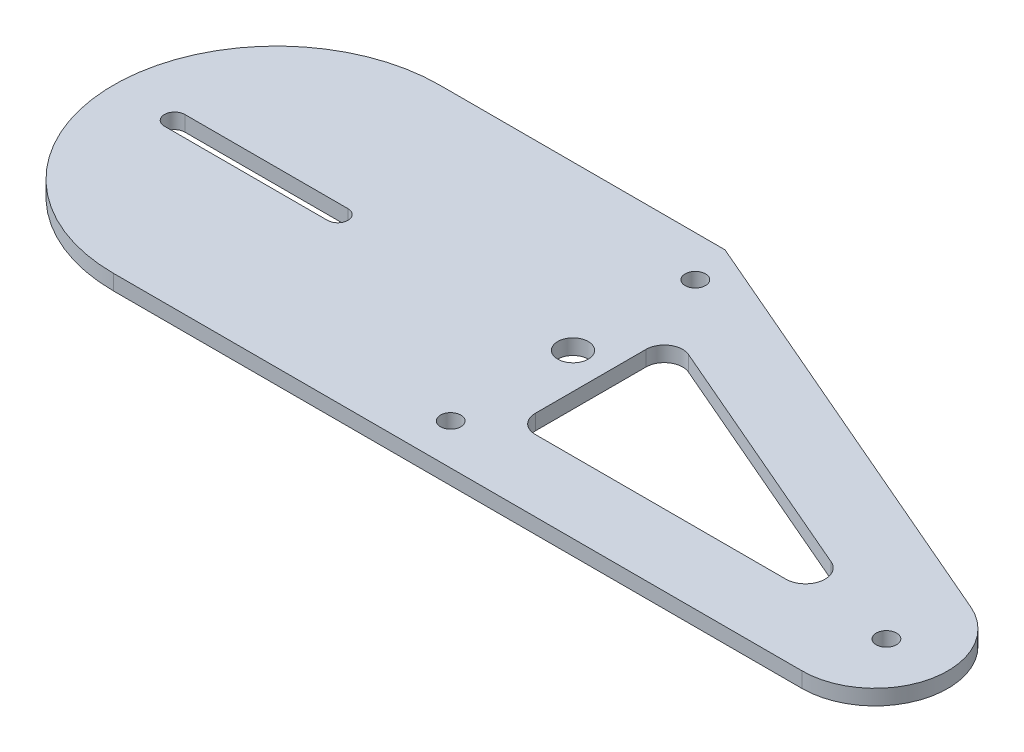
ISO-10303-21;
HEADER;
FILE_DESCRIPTION(('STEP AP214'),'2;1');
FILE_NAME('part.step','',(''),(''),'','','');
FILE_SCHEMA(('AUTOMOTIVE_DESIGN { 1 0 10303 214 1 1 1 1 }'));
ENDSEC;
DATA;
#1=APPLICATION_CONTEXT('core data for automotive mechanical design processes');
#2=APPLICATION_PROTOCOL_DEFINITION('international standard','automotive_design',2000,#1);
#3=PRODUCT_CONTEXT('',#1,'mechanical');
#4=PRODUCT('Part','Part','',(#3));
#5=PRODUCT_RELATED_PRODUCT_CATEGORY('part','',(#4));
#6=PRODUCT_DEFINITION_FORMATION('','',#4);
#7=PRODUCT_DEFINITION_CONTEXT('part definition',#1,'design');
#8=PRODUCT_DEFINITION('design','',#6,#7);
#9=PRODUCT_DEFINITION_SHAPE('','',#8);
#10=(LENGTH_UNIT() NAMED_UNIT(*) SI_UNIT(.MILLI.,.METRE.));
#11=(NAMED_UNIT(*) PLANE_ANGLE_UNIT() SI_UNIT($,.RADIAN.));
#12=(NAMED_UNIT(*) SI_UNIT($,.STERADIAN.) SOLID_ANGLE_UNIT());
#13=UNCERTAINTY_MEASURE_WITH_UNIT(LENGTH_MEASURE(1.E-05),#10,'distance_accuracy_value','');
#14=(GEOMETRIC_REPRESENTATION_CONTEXT(3) GLOBAL_UNCERTAINTY_ASSIGNED_CONTEXT((#13)) GLOBAL_UNIT_ASSIGNED_CONTEXT((#10,
#11,#12)) REPRESENTATION_CONTEXT('',''));
#15=CARTESIAN_POINT('',(0.,0.,0.));
#16=DIRECTION('',(0.,0.,1.));
#17=DIRECTION('',(1.,0.,0.));
#18=AXIS2_PLACEMENT_3D('',#15,#16,#17);
#19=CARTESIAN_POINT('',(-184.702735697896,9.525,-57.1499999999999));
#20=DIRECTION('',(0.,1.,0.));
#21=DIRECTION('',(0.,0.,1.));
#22=AXIS2_PLACEMENT_3D('',#19,#20,#21);
#23=PLANE('',#22);
#24=DIRECTION('',(1.,0.,0.));
#25=VECTOR('',#24,1.);
#26=CARTESIAN_POINT('',(-248.202735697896,9.525,-50.7999999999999));
#27=LINE('',#26,#25);
#28=CARTESIAN_POINT('',(-248.202735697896,9.525,-50.7999999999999));
#29=VERTEX_POINT('',#28);
#30=CARTESIAN_POINT('',(-146.602735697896,9.525,-50.7999999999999));
#31=VERTEX_POINT('',#30);
#32=EDGE_CURVE('E153',#29,#31,#27,.T.);
#33=ORIENTED_EDGE('',*,*,#32,.F.);
#34=CARTESIAN_POINT('',(-248.202735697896,9.525,-57.1499999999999));
#35=DIRECTION('',(0.,1.,0.));
#36=DIRECTION('',(0.,0.,1.));
#37=AXIS2_PLACEMENT_3D('',#34,#35,#36);
#38=CIRCLE('',#37,6.35);
#39=CARTESIAN_POINT('',(-248.202735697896,9.525,-63.4999999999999));
#40=VERTEX_POINT('',#39);
#41=EDGE_CURVE('E145',#40,#29,#38,.T.);
#42=ORIENTED_EDGE('',*,*,#41,.F.);
#43=DIRECTION('',(-1.,0.,0.));
#44=VECTOR('',#43,1.);
#45=CARTESIAN_POINT('',(-248.202735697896,9.525,-63.4999999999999));
#46=LINE('',#45,#44);
#47=CARTESIAN_POINT('',(-146.602735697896,9.525,-63.4999999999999));
#48=VERTEX_POINT('',#47);
#49=EDGE_CURVE('E168',#48,#40,#46,.T.);
#50=ORIENTED_EDGE('',*,*,#49,.F.);
#51=CARTESIAN_POINT('',(-146.602735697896,9.525,-57.1499999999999));
#52=DIRECTION('',(0.,1.,0.));
#53=DIRECTION('',(0.,0.,-1.));
#54=AXIS2_PLACEMENT_3D('',#51,#52,#53);
#55=CIRCLE('',#54,6.35);
#56=EDGE_CURVE('E166',#31,#48,#55,.T.);
#57=ORIENTED_EDGE('',*,*,#56,.F.);
#58=EDGE_LOOP('',(#33,#42,#50,#57));
#59=FACE_BOUND('',#58,.T.);
#60=CARTESIAN_POINT('',(0.,9.525,19.0500000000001));
#61=DIRECTION('',(0.,1.,0.));
#62=DIRECTION('',(0.,0.,1.));
#63=AXIS2_PLACEMENT_3D('',#60,#61,#62);
#64=CIRCLE('',#63,6.35000000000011);
#65=CARTESIAN_POINT('',(0.,9.525,25.4000000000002));
#66=VERTEX_POINT('',#65);
#67=EDGE_CURVE('E190',#66,#66,#64,.T.);
#68=ORIENTED_EDGE('',*,*,#67,.F.);
#69=EDGE_LOOP('',(#68));
#70=FACE_BOUND('',#69,.T.);
#71=DIRECTION('',(-0.918220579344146,0.,-0.396069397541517));
#72=VECTOR('',#71,1.);
#73=CARTESIAN_POINT('',(194.631834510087,9.525,-23.4103238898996));
#74=LINE('',#73,#72);
#75=CARTESIAN_POINT('',(194.631834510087,9.525,-23.4103238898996));
#76=VERTEX_POINT('',#75);
#77=CARTESIAN_POINT('',(38.1820732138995,9.525,-90.8940680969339));
#78=VERTEX_POINT('',#77);
#79=EDGE_CURVE('E204',#76,#78,#74,.T.);
#80=ORIENTED_EDGE('',*,*,#79,.F.);
#81=CARTESIAN_POINT('',(189.798129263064,9.525,-12.2041876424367));
#82=DIRECTION('',(0.,1.,0.));
#83=DIRECTION('',(0.,0.,-1.));
#84=AXIS2_PLACEMENT_3D('',#81,#82,#83);
#85=CIRCLE('',#84,12.2041876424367);
#86=CARTESIAN_POINT('',(189.798129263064,9.525,0.));
#87=VERTEX_POINT('',#86);
#88=EDGE_CURVE('E202',#87,#76,#85,.T.);
#89=ORIENTED_EDGE('',*,*,#88,.F.);
#90=DIRECTION('',(1.,0.,0.));
#91=VECTOR('',#90,1.);
#92=CARTESIAN_POINT('',(33.655,9.525,0.));
#93=LINE('',#92,#91);
#94=CARTESIAN_POINT('',(33.655,9.525,0.));
#95=VERTEX_POINT('',#94);
#96=EDGE_CURVE('E214',#95,#87,#93,.T.);
#97=ORIENTED_EDGE('',*,*,#96,.F.);
#98=CARTESIAN_POINT('',(33.655,9.525,-11.43));
#99=DIRECTION('',(0.,1.,0.));
#100=DIRECTION('',(0.,0.,1.));
#101=AXIS2_PLACEMENT_3D('',#98,#99,#100);
#102=CIRCLE('',#101,11.43);
#103=CARTESIAN_POINT('',(22.225,9.525,-11.43));
#104=VERTEX_POINT('',#103);
#105=EDGE_CURVE('E211',#104,#95,#102,.T.);
#106=ORIENTED_EDGE('',*,*,#105,.F.);
#107=DIRECTION('',(0.,0.,1.));
#108=VECTOR('',#107,1.);
#109=CARTESIAN_POINT('',(22.225,9.525,-80.3988068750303));
#110=LINE('',#109,#108);
#111=CARTESIAN_POINT('',(22.225,9.525,-80.3988068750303));
#112=VERTEX_POINT('',#111);
#113=EDGE_CURVE('E209',#112,#104,#110,.T.);
#114=ORIENTED_EDGE('',*,*,#113,.F.);
#115=CARTESIAN_POINT('',(33.655,9.525,-80.3988068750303));
#116=DIRECTION('',(0.,1.,0.));
#117=DIRECTION('',(0.,0.,1.));
#118=AXIS2_PLACEMENT_3D('',#115,#116,#117);
#119=CIRCLE('',#118,11.43);
#120=EDGE_CURVE('E207',#78,#112,#119,.T.);
#121=ORIENTED_EDGE('',*,*,#120,.F.);
#122=EDGE_LOOP('',(#80,#89,#97,#106,#114,#121));
#123=FACE_BOUND('',#122,.T.);
#124=CARTESIAN_POINT('',(-184.702735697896,9.525,-57.1499999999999));
#125=DIRECTION('',(0.,1.,0.));
#126=DIRECTION('',(0.,0.,1.));
#127=AXIS2_PLACEMENT_3D('',#124,#125,#126);
#128=CIRCLE('',#127,101.6);
#129=CARTESIAN_POINT('',(-184.702735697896,9.525,-158.75));
#130=VERTEX_POINT('',#129);
#131=CARTESIAN_POINT('',(-184.702735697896,9.525,44.4500000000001));
#132=VERTEX_POINT('',#131);
#133=EDGE_CURVE('E247',#130,#132,#128,.T.);
#134=ORIENTED_EDGE('',*,*,#133,.T.);
#135=DIRECTION('',(1.,0.,0.));
#136=VECTOR('',#135,1.);
#137=CARTESIAN_POINT('',(-184.702735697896,9.525,44.4500000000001));
#138=LINE('',#137,#136);
#139=CARTESIAN_POINT('',(244.363682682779,9.525,44.4500000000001));
#140=VERTEX_POINT('',#139);
#141=EDGE_CURVE('E250',#132,#140,#138,.T.);
#142=ORIENTED_EDGE('',*,*,#141,.T.);
#143=CARTESIAN_POINT('',(244.363682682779,9.525,-0.937628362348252));
#144=DIRECTION('',(0.,1.,0.));
#145=DIRECTION('',(0.,0.,-1.));
#146=AXIS2_PLACEMENT_3D('',#143,#144,#145);
#147=CIRCLE('',#146,45.3876283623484);
#148=CARTESIAN_POINT('',(262.340333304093,9.525,-42.6134827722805));
#149=VERTEX_POINT('',#148);
#150=EDGE_CURVE('E253',#140,#149,#147,.T.);
#151=ORIENTED_EDGE('',*,*,#150,.T.);
#152=DIRECTION('',(-0.918220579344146,0.,-0.396069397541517));
#153=VECTOR('',#152,1.);
#154=CARTESIAN_POINT('',(262.340333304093,9.525,-42.6134827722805));
#155=LINE('',#154,#153);
#156=CARTESIAN_POINT('',(-6.30078143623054,9.525,-158.490350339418));
#157=VERTEX_POINT('',#156);
#158=EDGE_CURVE('E255',#149,#157,#155,.T.);
#159=ORIENTED_EDGE('',*,*,#158,.T.);
#160=CARTESIAN_POINT('',(-7.55830177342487,9.525,-155.575));
#161=DIRECTION('',(0.,1.,0.));
#162=DIRECTION('',(0.,0.,1.));
#163=AXIS2_PLACEMENT_3D('',#160,#161,#162);
#164=CIRCLE('',#163,3.17500000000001);
#165=CARTESIAN_POINT('',(-7.55830177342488,9.525,-158.75));
#166=VERTEX_POINT('',#165);
#167=EDGE_CURVE('E257',#157,#166,#164,.T.);
#168=ORIENTED_EDGE('',*,*,#167,.T.);
#169=DIRECTION('',(-1.,0.,0.));
#170=VECTOR('',#169,1.);
#171=CARTESIAN_POINT('',(-7.55830177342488,9.525,-158.75));
#172=LINE('',#171,#170);
#173=EDGE_CURVE('E259',#166,#130,#172,.T.);
#174=ORIENTED_EDGE('',*,*,#173,.T.);
#175=EDGE_LOOP('',(#134,#142,#151,#159,#168,#174));
#176=FACE_BOUND('',#175,.T.);
#177=CARTESIAN_POINT('',(0.,9.525,-133.35));
#178=DIRECTION('',(0.,1.,0.));
#179=DIRECTION('',(0.,0.,1.));
#180=AXIS2_PLACEMENT_3D('',#177,#178,#179);
#181=CIRCLE('',#180,6.35000000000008);
#182=CARTESIAN_POINT('',(0.,9.525,-127.));
#183=VERTEX_POINT('',#182);
#184=EDGE_CURVE('E196',#183,#183,#181,.T.);
#185=ORIENTED_EDGE('',*,*,#184,.F.);
#186=EDGE_LOOP('',(#185));
#187=FACE_BOUND('',#186,.T.);
#188=CARTESIAN_POINT('',(0.,9.525,-57.1499999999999));
#189=DIRECTION('',(0.,1.,0.));
#190=DIRECTION('',(0.,0.,1.));
#191=AXIS2_PLACEMENT_3D('',#188,#189,#190);
#192=CIRCLE('',#191,9.52500000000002);
#193=CARTESIAN_POINT('',(0.,9.525,-47.6249999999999));
#194=VERTEX_POINT('',#193);
#195=EDGE_CURVE('E184',#194,#194,#192,.T.);
#196=ORIENTED_EDGE('',*,*,#195,.F.);
#197=EDGE_LOOP('',(#196));
#198=FACE_BOUND('',#197,.T.);
#199=CARTESIAN_POINT('',(253.352007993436,9.525,0.918258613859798));
#200=DIRECTION('',(0.,1.,0.));
#201=DIRECTION('',(0.,0.,1.));
#202=AXIS2_PLACEMENT_3D('',#199,#200,#201);
#203=CIRCLE('',#202,6.35);
#204=CARTESIAN_POINT('',(253.352007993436,9.525,7.2682586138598));
#205=VERTEX_POINT('',#204);
#206=EDGE_CURVE('E174',#205,#205,#203,.T.);
#207=ORIENTED_EDGE('',*,*,#206,.F.);
#208=EDGE_LOOP('',(#207));
#209=FACE_BOUND('',#208,.T.);
#210=ADVANCED_FACE('F32',(#59,#70,#123,#176,#187,#198,#209),#23,.T.);
#211=CARTESIAN_POINT('',(-184.702735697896,0.,-57.1499999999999));
#212=DIRECTION('',(0.,1.,0.));
#213=DIRECTION('',(0.,0.,1.));
#214=AXIS2_PLACEMENT_3D('',#211,#212,#213);
#215=PLANE('',#214);
#216=CARTESIAN_POINT('',(-248.202735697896,0.,-57.1499999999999));
#217=DIRECTION('',(0.,1.,0.));
#218=DIRECTION('',(0.,0.,1.));
#219=AXIS2_PLACEMENT_3D('',#216,#217,#218);
#220=CIRCLE('',#219,6.35);
#221=CARTESIAN_POINT('',(-248.202735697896,0.,-63.4999999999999));
#222=VERTEX_POINT('',#221);
#223=CARTESIAN_POINT('',(-248.202735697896,0.,-50.7999999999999));
#224=VERTEX_POINT('',#223);
#225=EDGE_CURVE('E55',#222,#224,#220,.T.);
#226=ORIENTED_EDGE('',*,*,#225,.T.);
#227=DIRECTION('',(1.,0.,0.));
#228=VECTOR('',#227,1.);
#229=CARTESIAN_POINT('',(-248.202735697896,0.,-50.7999999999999));
#230=LINE('',#229,#228);
#231=CARTESIAN_POINT('',(-146.602735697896,0.,-50.7999999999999));
#232=VERTEX_POINT('',#231);
#233=EDGE_CURVE('E160',#224,#232,#230,.T.);
#234=ORIENTED_EDGE('',*,*,#233,.T.);
#235=CARTESIAN_POINT('',(-146.602735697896,0.,-57.1499999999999));
#236=DIRECTION('',(0.,1.,0.));
#237=DIRECTION('',(0.,0.,-1.));
#238=AXIS2_PLACEMENT_3D('',#235,#236,#237);
#239=CIRCLE('',#238,6.35);
#240=CARTESIAN_POINT('',(-146.602735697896,0.,-63.4999999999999));
#241=VERTEX_POINT('',#240);
#242=EDGE_CURVE('E176',#232,#241,#239,.T.);
#243=ORIENTED_EDGE('',*,*,#242,.T.);
#244=DIRECTION('',(-1.,0.,0.));
#245=VECTOR('',#244,1.);
#246=CARTESIAN_POINT('',(-248.202735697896,0.,-63.4999999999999));
#247=LINE('',#246,#245);
#248=EDGE_CURVE('E154',#241,#222,#247,.T.);
#249=ORIENTED_EDGE('',*,*,#248,.T.);
#250=EDGE_LOOP('',(#226,#234,#243,#249));
#251=FACE_BOUND('',#250,.T.);
#252=CARTESIAN_POINT('',(0.,0.,19.0500000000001));
#253=DIRECTION('',(0.,1.,0.));
#254=DIRECTION('',(0.,0.,1.));
#255=AXIS2_PLACEMENT_3D('',#252,#253,#254);
#256=CIRCLE('',#255,6.35000000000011);
#257=CARTESIAN_POINT('',(0.,0.,25.4000000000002));
#258=VERTEX_POINT('',#257);
#259=EDGE_CURVE('E187',#258,#258,#256,.T.);
#260=ORIENTED_EDGE('',*,*,#259,.T.);
#261=EDGE_LOOP('',(#260));
#262=FACE_BOUND('',#261,.T.);
#263=CARTESIAN_POINT('',(189.798129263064,0.,-12.2041876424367));
#264=DIRECTION('',(0.,1.,0.));
#265=DIRECTION('',(0.,0.,-1.));
#266=AXIS2_PLACEMENT_3D('',#263,#264,#265);
#267=CIRCLE('',#266,12.2041876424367);
#268=CARTESIAN_POINT('',(189.798129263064,0.,0.));
#269=VERTEX_POINT('',#268);
#270=CARTESIAN_POINT('',(194.631834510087,0.,-23.4103238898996));
#271=VERTEX_POINT('',#270);
#272=EDGE_CURVE('E199',#269,#271,#267,.T.);
#273=ORIENTED_EDGE('',*,*,#272,.T.);
#274=DIRECTION('',(-0.918220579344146,0.,-0.396069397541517));
#275=VECTOR('',#274,1.);
#276=CARTESIAN_POINT('',(194.631834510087,0.,-23.4103238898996));
#277=LINE('',#276,#275);
#278=CARTESIAN_POINT('',(38.1820732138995,0.,-90.8940680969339));
#279=VERTEX_POINT('',#278);
#280=EDGE_CURVE('E219',#271,#279,#277,.T.);
#281=ORIENTED_EDGE('',*,*,#280,.T.);
#282=CARTESIAN_POINT('',(33.655,0.,-80.3988068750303));
#283=DIRECTION('',(0.,1.,0.));
#284=DIRECTION('',(0.,0.,1.));
#285=AXIS2_PLACEMENT_3D('',#282,#283,#284);
#286=CIRCLE('',#285,11.43);
#287=CARTESIAN_POINT('',(22.225,0.,-80.3988068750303));
#288=VERTEX_POINT('',#287);
#289=EDGE_CURVE('E222',#279,#288,#286,.T.);
#290=ORIENTED_EDGE('',*,*,#289,.T.);
#291=DIRECTION('',(0.,0.,1.));
#292=VECTOR('',#291,1.);
#293=CARTESIAN_POINT('',(22.225,0.,-80.3988068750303));
#294=LINE('',#293,#292);
#295=CARTESIAN_POINT('',(22.225,0.,-11.43));
#296=VERTEX_POINT('',#295);
#297=EDGE_CURVE('E225',#288,#296,#294,.T.);
#298=ORIENTED_EDGE('',*,*,#297,.T.);
#299=CARTESIAN_POINT('',(33.655,0.,-11.43));
#300=DIRECTION('',(0.,1.,0.));
#301=DIRECTION('',(0.,0.,1.));
#302=AXIS2_PLACEMENT_3D('',#299,#300,#301);
#303=CIRCLE('',#302,11.43);
#304=CARTESIAN_POINT('',(33.655,0.,0.));
#305=VERTEX_POINT('',#304);
#306=EDGE_CURVE('E228',#296,#305,#303,.T.);
#307=ORIENTED_EDGE('',*,*,#306,.T.);
#308=DIRECTION('',(1.,0.,0.));
#309=VECTOR('',#308,1.);
#310=CARTESIAN_POINT('',(33.655,0.,0.));
#311=LINE('',#310,#309);
#312=EDGE_CURVE('E205',#305,#269,#311,.T.);
#313=ORIENTED_EDGE('',*,*,#312,.T.);
#314=EDGE_LOOP('',(#273,#281,#290,#298,#307,#313));
#315=FACE_BOUND('',#314,.T.);
#316=CARTESIAN_POINT('',(-184.702735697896,0.,-57.1499999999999));
#317=DIRECTION('',(0.,1.,0.));
#318=DIRECTION('',(0.,0.,1.));
#319=AXIS2_PLACEMENT_3D('',#316,#317,#318);
#320=CIRCLE('',#319,101.6);
#321=CARTESIAN_POINT('',(-184.702735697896,0.,-158.75));
#322=VERTEX_POINT('',#321);
#323=CARTESIAN_POINT('',(-184.702735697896,0.,44.4500000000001));
#324=VERTEX_POINT('',#323);
#325=EDGE_CURVE('E246',#322,#324,#320,.T.);
#326=ORIENTED_EDGE('',*,*,#325,.F.);
#327=DIRECTION('',(-1.,0.,0.));
#328=VECTOR('',#327,1.);
#329=CARTESIAN_POINT('',(-7.55830177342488,0.,-158.75));
#330=LINE('',#329,#328);
#331=CARTESIAN_POINT('',(-7.55830177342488,0.,-158.75));
#332=VERTEX_POINT('',#331);
#333=EDGE_CURVE('E251',#332,#322,#330,.T.);
#334=ORIENTED_EDGE('',*,*,#333,.F.);
#335=CARTESIAN_POINT('',(-7.55830177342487,0.,-155.575));
#336=DIRECTION('',(0.,1.,0.));
#337=DIRECTION('',(0.,0.,1.));
#338=AXIS2_PLACEMENT_3D('',#335,#336,#337);
#339=CIRCLE('',#338,3.17500000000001);
#340=CARTESIAN_POINT('',(-6.30078143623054,0.,-158.490350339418));
#341=VERTEX_POINT('',#340);
#342=EDGE_CURVE('E270',#341,#332,#339,.T.);
#343=ORIENTED_EDGE('',*,*,#342,.F.);
#344=DIRECTION('',(-0.918220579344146,0.,-0.396069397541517));
#345=VECTOR('',#344,1.);
#346=CARTESIAN_POINT('',(262.340333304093,0.,-42.6134827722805));
#347=LINE('',#346,#345);
#348=CARTESIAN_POINT('',(262.340333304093,0.,-42.6134827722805));
#349=VERTEX_POINT('',#348);
#350=EDGE_CURVE('E268',#349,#341,#347,.T.);
#351=ORIENTED_EDGE('',*,*,#350,.F.);
#352=CARTESIAN_POINT('',(244.363682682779,0.,-0.937628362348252));
#353=DIRECTION('',(0.,1.,0.));
#354=DIRECTION('',(0.,0.,-1.));
#355=AXIS2_PLACEMENT_3D('',#352,#353,#354);
#356=CIRCLE('',#355,45.3876283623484);
#357=CARTESIAN_POINT('',(244.363682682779,0.,44.4500000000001));
#358=VERTEX_POINT('',#357);
#359=EDGE_CURVE('E266',#358,#349,#356,.T.);
#360=ORIENTED_EDGE('',*,*,#359,.F.);
#361=DIRECTION('',(1.,0.,0.));
#362=VECTOR('',#361,1.);
#363=CARTESIAN_POINT('',(-184.702735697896,0.,44.4500000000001));
#364=LINE('',#363,#362);
#365=EDGE_CURVE('E264',#324,#358,#364,.T.);
#366=ORIENTED_EDGE('',*,*,#365,.F.);
#367=EDGE_LOOP('',(#326,#334,#343,#351,#360,#366));
#368=FACE_BOUND('',#367,.T.);
#369=CARTESIAN_POINT('',(0.,0.,-133.35));
#370=DIRECTION('',(0.,1.,0.));
#371=DIRECTION('',(0.,0.,1.));
#372=AXIS2_PLACEMENT_3D('',#369,#370,#371);
#373=CIRCLE('',#372,6.35000000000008);
#374=CARTESIAN_POINT('',(0.,0.,-127.));
#375=VERTEX_POINT('',#374);
#376=EDGE_CURVE('E193',#375,#375,#373,.T.);
#377=ORIENTED_EDGE('',*,*,#376,.T.);
#378=EDGE_LOOP('',(#377));
#379=FACE_BOUND('',#378,.T.);
#380=CARTESIAN_POINT('',(0.,0.,-57.1499999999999));
#381=DIRECTION('',(0.,1.,0.));
#382=DIRECTION('',(0.,0.,1.));
#383=AXIS2_PLACEMENT_3D('',#380,#381,#382);
#384=CIRCLE('',#383,9.52500000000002);
#385=CARTESIAN_POINT('',(0.,0.,-47.6249999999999));
#386=VERTEX_POINT('',#385);
#387=EDGE_CURVE('E161',#386,#386,#384,.T.);
#388=ORIENTED_EDGE('',*,*,#387,.T.);
#389=EDGE_LOOP('',(#388));
#390=FACE_BOUND('',#389,.T.);
#391=CARTESIAN_POINT('',(253.352007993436,0.,0.918258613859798));
#392=DIRECTION('',(0.,1.,0.));
#393=DIRECTION('',(0.,0.,1.));
#394=AXIS2_PLACEMENT_3D('',#391,#392,#393);
#395=CIRCLE('',#394,6.35);
#396=CARTESIAN_POINT('',(253.352007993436,0.,7.2682586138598));
#397=VERTEX_POINT('',#396);
#398=EDGE_CURVE('E387',#397,#397,#395,.T.);
#399=ORIENTED_EDGE('',*,*,#398,.T.);
#400=EDGE_LOOP('',(#399));
#401=FACE_BOUND('',#400,.T.);
#402=ADVANCED_FACE('F294',(#251,#262,#315,#368,#379,#390,#401),#215,.F.);
#403=CARTESIAN_POINT('',(-184.702735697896,9.525,-57.1499999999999));
#404=DIRECTION('',(0.,-1.,0.));
#405=DIRECTION('',(0.,0.,-1.));
#406=AXIS2_PLACEMENT_3D('',#403,#404,#405);
#407=CYLINDRICAL_SURFACE('',#406,101.6);
#408=ORIENTED_EDGE('',*,*,#325,.T.);
#409=DIRECTION('',(0.,-1.,0.));
#410=VECTOR('',#409,1.);
#411=CARTESIAN_POINT('',(-184.702735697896,9.525,44.4500000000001));
#412=LINE('',#411,#410);
#413=EDGE_CURVE('E11',#132,#324,#412,.T.);
#414=ORIENTED_EDGE('',*,*,#413,.F.);
#415=ORIENTED_EDGE('',*,*,#133,.F.);
#416=DIRECTION('',(0.,-1.,0.));
#417=VECTOR('',#416,1.);
#418=CARTESIAN_POINT('',(-184.702735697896,9.525,-158.75));
#419=LINE('',#418,#417);
#420=EDGE_CURVE('E261',#130,#322,#419,.T.);
#421=ORIENTED_EDGE('',*,*,#420,.T.);
#422=EDGE_LOOP('',(#408,#414,#415,#421));
#423=FACE_BOUND('',#422,.T.);
#424=ADVANCED_FACE('F34',(#423),#407,.T.);
#425=CARTESIAN_POINT('',(-184.702735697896,9.525,44.4500000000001));
#426=DIRECTION('',(0.,0.,-1.));
#427=DIRECTION('',(-1.,0.,0.));
#428=AXIS2_PLACEMENT_3D('',#425,#426,#427);
#429=PLANE('',#428);
#430=ORIENTED_EDGE('',*,*,#365,.T.);
#431=DIRECTION('',(0.,-1.,0.));
#432=VECTOR('',#431,1.);
#433=CARTESIAN_POINT('',(244.363682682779,9.525,44.4500000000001));
#434=LINE('',#433,#432);
#435=EDGE_CURVE('E40',#140,#358,#434,.T.);
#436=ORIENTED_EDGE('',*,*,#435,.F.);
#437=ORIENTED_EDGE('',*,*,#141,.F.);
#438=ORIENTED_EDGE('',*,*,#413,.T.);
#439=EDGE_LOOP('',(#430,#436,#437,#438));
#440=FACE_BOUND('',#439,.T.);
#441=ADVANCED_FACE('F312',(#440),#429,.F.);
#442=CARTESIAN_POINT('',(244.363682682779,9.525,-0.937628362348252));
#443=DIRECTION('',(0.,-1.,0.));
#444=DIRECTION('',(0.,0.,-1.));
#445=AXIS2_PLACEMENT_3D('',#442,#443,#444);
#446=CYLINDRICAL_SURFACE('',#445,45.3876283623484);
#447=ORIENTED_EDGE('',*,*,#359,.T.);
#448=DIRECTION('',(0.,-1.,0.));
#449=VECTOR('',#448,1.);
#450=CARTESIAN_POINT('',(262.340333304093,9.525,-42.6134827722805));
#451=LINE('',#450,#449);
#452=EDGE_CURVE('E281',#149,#349,#451,.T.);
#453=ORIENTED_EDGE('',*,*,#452,.F.);
#454=ORIENTED_EDGE('',*,*,#150,.F.);
#455=ORIENTED_EDGE('',*,*,#435,.T.);
#456=EDGE_LOOP('',(#447,#453,#454,#455));
#457=FACE_BOUND('',#456,.T.);
#458=ADVANCED_FACE('F288',(#457),#446,.T.);
#459=CARTESIAN_POINT('',(262.340333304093,9.525,-42.6134827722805));
#460=DIRECTION('',(-0.396069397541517,0.,0.918220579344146));
#461=DIRECTION('',(0.918220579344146,0.,0.396069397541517));
#462=AXIS2_PLACEMENT_3D('',#459,#460,#461);
#463=PLANE('',#462);
#464=ORIENTED_EDGE('',*,*,#350,.T.);
#465=DIRECTION('',(0.,-1.,0.));
#466=VECTOR('',#465,1.);
#467=CARTESIAN_POINT('',(-6.30078143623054,9.525,-158.490350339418));
#468=LINE('',#467,#466);
#469=EDGE_CURVE('E278',#157,#341,#468,.T.);
#470=ORIENTED_EDGE('',*,*,#469,.F.);
#471=ORIENTED_EDGE('',*,*,#158,.F.);
#472=ORIENTED_EDGE('',*,*,#452,.T.);
#473=EDGE_LOOP('',(#464,#470,#471,#472));
#474=FACE_BOUND('',#473,.T.);
#475=ADVANCED_FACE('F300',(#474),#463,.F.);
#476=CARTESIAN_POINT('',(-7.55830177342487,9.525,-155.575));
#477=DIRECTION('',(0.,-1.,0.));
#478=DIRECTION('',(0.,0.,-1.));
#479=AXIS2_PLACEMENT_3D('',#476,#477,#478);
#480=CYLINDRICAL_SURFACE('',#479,3.17500000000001);
#481=ORIENTED_EDGE('',*,*,#342,.T.);
#482=DIRECTION('',(0.,-1.,0.));
#483=VECTOR('',#482,1.);
#484=CARTESIAN_POINT('',(-7.55830177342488,9.525,-158.75));
#485=LINE('',#484,#483);
#486=EDGE_CURVE('E275',#166,#332,#485,.T.);
#487=ORIENTED_EDGE('',*,*,#486,.F.);
#488=ORIENTED_EDGE('',*,*,#167,.F.);
#489=ORIENTED_EDGE('',*,*,#469,.T.);
#490=EDGE_LOOP('',(#481,#487,#488,#489));
#491=FACE_BOUND('',#490,.T.);
#492=ADVANCED_FACE('F304',(#491),#480,.T.);
#493=CARTESIAN_POINT('',(-7.55830177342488,9.525,-158.75));
#494=DIRECTION('',(0.,0.,1.));
#495=DIRECTION('',(1.,0.,0.));
#496=AXIS2_PLACEMENT_3D('',#493,#494,#495);
#497=PLANE('',#496);
#498=ORIENTED_EDGE('',*,*,#333,.T.);
#499=ORIENTED_EDGE('',*,*,#420,.F.);
#500=ORIENTED_EDGE('',*,*,#173,.F.);
#501=ORIENTED_EDGE('',*,*,#486,.T.);
#502=EDGE_LOOP('',(#498,#499,#500,#501));
#503=FACE_BOUND('',#502,.T.);
#504=ADVANCED_FACE('F315',(#503),#497,.F.);
#505=CARTESIAN_POINT('',(189.798129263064,9.525,-12.2041876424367));
#506=DIRECTION('',(0.,-1.,0.));
#507=DIRECTION('',(0.,0.,-1.));
#508=AXIS2_PLACEMENT_3D('',#505,#506,#507);
#509=CYLINDRICAL_SURFACE('',#508,12.2041876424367);
#510=ORIENTED_EDGE('',*,*,#272,.F.);
#511=DIRECTION('',(0.,-1.,0.));
#512=VECTOR('',#511,1.);
#513=CARTESIAN_POINT('',(189.798129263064,9.525,0.));
#514=LINE('',#513,#512);
#515=EDGE_CURVE('E216',#87,#269,#514,.T.);
#516=ORIENTED_EDGE('',*,*,#515,.F.);
#517=ORIENTED_EDGE('',*,*,#88,.T.);
#518=DIRECTION('',(0.,-1.,0.));
#519=VECTOR('',#518,1.);
#520=CARTESIAN_POINT('',(194.631834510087,9.525,-23.4103238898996));
#521=LINE('',#520,#519);
#522=EDGE_CURVE('E243',#76,#271,#521,.T.);
#523=ORIENTED_EDGE('',*,*,#522,.T.);
#524=EDGE_LOOP('',(#510,#516,#517,#523));
#525=FACE_BOUND('',#524,.T.);
#526=ADVANCED_FACE('F317',(#525),#509,.F.);
#527=CARTESIAN_POINT('',(194.631834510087,9.525,-23.4103238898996));
#528=DIRECTION('',(-0.396069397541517,0.,0.918220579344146));
#529=DIRECTION('',(0.918220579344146,0.,0.396069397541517));
#530=AXIS2_PLACEMENT_3D('',#527,#528,#529);
#531=PLANE('',#530);
#532=ORIENTED_EDGE('',*,*,#280,.F.);
#533=ORIENTED_EDGE('',*,*,#522,.F.);
#534=ORIENTED_EDGE('',*,*,#79,.T.);
#535=DIRECTION('',(0.,-1.,0.));
#536=VECTOR('',#535,1.);
#537=CARTESIAN_POINT('',(38.1820732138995,9.525,-90.8940680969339));
#538=LINE('',#537,#536);
#539=EDGE_CURVE('E241',#78,#279,#538,.T.);
#540=ORIENTED_EDGE('',*,*,#539,.T.);
#541=EDGE_LOOP('',(#532,#533,#534,#540));
#542=FACE_BOUND('',#541,.T.);
#543=ADVANCED_FACE('F323',(#542),#531,.T.);
#544=CARTESIAN_POINT('',(33.655,9.525,-80.3988068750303));
#545=DIRECTION('',(0.,-1.,0.));
#546=DIRECTION('',(0.,0.,-1.));
#547=AXIS2_PLACEMENT_3D('',#544,#545,#546);
#548=CYLINDRICAL_SURFACE('',#547,11.43);
#549=ORIENTED_EDGE('',*,*,#289,.F.);
#550=ORIENTED_EDGE('',*,*,#539,.F.);
#551=ORIENTED_EDGE('',*,*,#120,.T.);
#552=DIRECTION('',(0.,-1.,0.));
#553=VECTOR('',#552,1.);
#554=CARTESIAN_POINT('',(22.225,9.525,-80.3988068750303));
#555=LINE('',#554,#553);
#556=EDGE_CURVE('E239',#112,#288,#555,.T.);
#557=ORIENTED_EDGE('',*,*,#556,.T.);
#558=EDGE_LOOP('',(#549,#550,#551,#557));
#559=FACE_BOUND('',#558,.T.);
#560=ADVANCED_FACE('F337',(#559),#548,.F.);
#561=CARTESIAN_POINT('',(22.225,9.525,-80.3988068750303));
#562=DIRECTION('',(1.,0.,0.));
#563=DIRECTION('',(0.,0.,-1.));
#564=AXIS2_PLACEMENT_3D('',#561,#562,#563);
#565=PLANE('',#564);
#566=ORIENTED_EDGE('',*,*,#297,.F.);
#567=ORIENTED_EDGE('',*,*,#556,.F.);
#568=ORIENTED_EDGE('',*,*,#113,.T.);
#569=DIRECTION('',(0.,-1.,0.));
#570=VECTOR('',#569,1.);
#571=CARTESIAN_POINT('',(22.225,9.525,-11.43));
#572=LINE('',#571,#570);
#573=EDGE_CURVE('E237',#104,#296,#572,.T.);
#574=ORIENTED_EDGE('',*,*,#573,.T.);
#575=EDGE_LOOP('',(#566,#567,#568,#574));
#576=FACE_BOUND('',#575,.T.);
#577=ADVANCED_FACE('F341',(#576),#565,.T.);
#578=CARTESIAN_POINT('',(33.655,9.525,-11.43));
#579=DIRECTION('',(0.,-1.,0.));
#580=DIRECTION('',(0.,0.,-1.));
#581=AXIS2_PLACEMENT_3D('',#578,#579,#580);
#582=CYLINDRICAL_SURFACE('',#581,11.43);
#583=ORIENTED_EDGE('',*,*,#306,.F.);
#584=ORIENTED_EDGE('',*,*,#573,.F.);
#585=ORIENTED_EDGE('',*,*,#105,.T.);
#586=DIRECTION('',(0.,-1.,0.));
#587=VECTOR('',#586,1.);
#588=CARTESIAN_POINT('',(33.655,9.525,0.));
#589=LINE('',#588,#587);
#590=EDGE_CURVE('E235',#95,#305,#589,.T.);
#591=ORIENTED_EDGE('',*,*,#590,.T.);
#592=EDGE_LOOP('',(#583,#584,#585,#591));
#593=FACE_BOUND('',#592,.T.);
#594=ADVANCED_FACE('F345',(#593),#582,.F.);
#595=CARTESIAN_POINT('',(33.655,9.525,0.));
#596=DIRECTION('',(0.,0.,-1.));
#597=DIRECTION('',(-1.,0.,0.));
#598=AXIS2_PLACEMENT_3D('',#595,#596,#597);
#599=PLANE('',#598);
#600=ORIENTED_EDGE('',*,*,#312,.F.);
#601=ORIENTED_EDGE('',*,*,#590,.F.);
#602=ORIENTED_EDGE('',*,*,#96,.T.);
#603=ORIENTED_EDGE('',*,*,#515,.T.);
#604=EDGE_LOOP('',(#600,#601,#602,#603));
#605=FACE_BOUND('',#604,.T.);
#606=ADVANCED_FACE('F349',(#605),#599,.T.);
#607=CARTESIAN_POINT('',(0.,9.525,-133.35));
#608=DIRECTION('',(0.,-1.,0.));
#609=DIRECTION('',(0.,0.,-1.));
#610=AXIS2_PLACEMENT_3D('',#607,#608,#609);
#611=CYLINDRICAL_SURFACE('',#610,6.35000000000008);
#612=ORIENTED_EDGE('',*,*,#184,.T.);
#613=EDGE_LOOP('',(#612));
#614=FACE_BOUND('',#613,.T.);
#615=ORIENTED_EDGE('',*,*,#376,.F.);
#616=EDGE_LOOP('',(#615));
#617=FACE_BOUND('',#616,.T.);
#618=ADVANCED_FACE('F353',(#614,#617),#611,.F.);
#619=CARTESIAN_POINT('',(0.,9.525,19.0500000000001));
#620=DIRECTION('',(0.,-1.,0.));
#621=DIRECTION('',(0.,0.,-1.));
#622=AXIS2_PLACEMENT_3D('',#619,#620,#621);
#623=CYLINDRICAL_SURFACE('',#622,6.35000000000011);
#624=ORIENTED_EDGE('',*,*,#67,.T.);
#625=EDGE_LOOP('',(#624));
#626=FACE_BOUND('',#625,.T.);
#627=ORIENTED_EDGE('',*,*,#259,.F.);
#628=EDGE_LOOP('',(#627));
#629=FACE_BOUND('',#628,.T.);
#630=ADVANCED_FACE('F357',(#626,#629),#623,.F.);
#631=CARTESIAN_POINT('',(0.,9.525,-57.1499999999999));
#632=DIRECTION('',(0.,-1.,0.));
#633=DIRECTION('',(0.,0.,-1.));
#634=AXIS2_PLACEMENT_3D('',#631,#632,#633);
#635=CYLINDRICAL_SURFACE('',#634,9.52500000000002);
#636=ORIENTED_EDGE('',*,*,#195,.T.);
#637=EDGE_LOOP('',(#636));
#638=FACE_BOUND('',#637,.T.);
#639=ORIENTED_EDGE('',*,*,#387,.F.);
#640=EDGE_LOOP('',(#639));
#641=FACE_BOUND('',#640,.T.);
#642=ADVANCED_FACE('F361',(#638,#641),#635,.F.);
#643=CARTESIAN_POINT('',(-248.202735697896,9.525,-57.1499999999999));
#644=DIRECTION('',(0.,-1.,0.));
#645=DIRECTION('',(0.,0.,-1.));
#646=AXIS2_PLACEMENT_3D('',#643,#644,#645);
#647=CYLINDRICAL_SURFACE('',#646,6.35);
#648=ORIENTED_EDGE('',*,*,#225,.F.);
#649=DIRECTION('',(0.,-1.,0.));
#650=VECTOR('',#649,1.);
#651=CARTESIAN_POINT('',(-248.202735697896,9.525,-63.4999999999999));
#652=LINE('',#651,#650);
#653=EDGE_CURVE('E149',#40,#222,#652,.T.);
#654=ORIENTED_EDGE('',*,*,#653,.F.);
#655=ORIENTED_EDGE('',*,*,#41,.T.);
#656=DIRECTION('',(0.,-1.,0.));
#657=VECTOR('',#656,1.);
#658=CARTESIAN_POINT('',(-248.202735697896,9.525,-50.7999999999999));
#659=LINE('',#658,#657);
#660=EDGE_CURVE('E148',#29,#224,#659,.T.);
#661=ORIENTED_EDGE('',*,*,#660,.T.);
#662=EDGE_LOOP('',(#648,#654,#655,#661));
#663=FACE_BOUND('',#662,.T.);
#664=ADVANCED_FACE('F147',(#663),#647,.F.);
#665=CARTESIAN_POINT('',(-248.202735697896,9.525,-50.7999999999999));
#666=DIRECTION('',(0.,0.,-1.));
#667=DIRECTION('',(-1.,0.,0.));
#668=AXIS2_PLACEMENT_3D('',#665,#666,#667);
#669=PLANE('',#668);
#670=ORIENTED_EDGE('',*,*,#233,.F.);
#671=ORIENTED_EDGE('',*,*,#660,.F.);
#672=ORIENTED_EDGE('',*,*,#32,.T.);
#673=DIRECTION('',(0.,-1.,0.));
#674=VECTOR('',#673,1.);
#675=CARTESIAN_POINT('',(-146.602735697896,9.525,-50.7999999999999));
#676=LINE('',#675,#674);
#677=EDGE_CURVE('E162',#31,#232,#676,.T.);
#678=ORIENTED_EDGE('',*,*,#677,.T.);
#679=EDGE_LOOP('',(#670,#671,#672,#678));
#680=FACE_BOUND('',#679,.T.);
#681=ADVANCED_FACE('F157',(#680),#669,.T.);
#682=CARTESIAN_POINT('',(-146.602735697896,9.525,-57.1499999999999));
#683=DIRECTION('',(0.,-1.,0.));
#684=DIRECTION('',(0.,0.,-1.));
#685=AXIS2_PLACEMENT_3D('',#682,#683,#684);
#686=CYLINDRICAL_SURFACE('',#685,6.35);
#687=ORIENTED_EDGE('',*,*,#242,.F.);
#688=ORIENTED_EDGE('',*,*,#677,.F.);
#689=ORIENTED_EDGE('',*,*,#56,.T.);
#690=DIRECTION('',(0.,-1.,0.));
#691=VECTOR('',#690,1.);
#692=CARTESIAN_POINT('',(-146.602735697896,9.525,-63.4999999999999));
#693=LINE('',#692,#691);
#694=EDGE_CURVE('E47',#48,#241,#693,.T.);
#695=ORIENTED_EDGE('',*,*,#694,.T.);
#696=EDGE_LOOP('',(#687,#688,#689,#695));
#697=FACE_BOUND('',#696,.T.);
#698=ADVANCED_FACE('F370',(#697),#686,.F.);
#699=CARTESIAN_POINT('',(-248.202735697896,9.525,-63.4999999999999));
#700=DIRECTION('',(0.,0.,1.));
#701=DIRECTION('',(1.,0.,0.));
#702=AXIS2_PLACEMENT_3D('',#699,#700,#701);
#703=PLANE('',#702);
#704=ORIENTED_EDGE('',*,*,#248,.F.);
#705=ORIENTED_EDGE('',*,*,#694,.F.);
#706=ORIENTED_EDGE('',*,*,#49,.T.);
#707=ORIENTED_EDGE('',*,*,#653,.T.);
#708=EDGE_LOOP('',(#704,#705,#706,#707));
#709=FACE_BOUND('',#708,.T.);
#710=ADVANCED_FACE('F373',(#709),#703,.T.);
#711=CARTESIAN_POINT('',(253.352007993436,9.525,0.918258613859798));
#712=DIRECTION('',(0.,-1.,0.));
#713=DIRECTION('',(0.,0.,-1.));
#714=AXIS2_PLACEMENT_3D('',#711,#712,#713);
#715=CYLINDRICAL_SURFACE('',#714,6.35);
#716=ORIENTED_EDGE('',*,*,#206,.T.);
#717=EDGE_LOOP('',(#716));
#718=FACE_BOUND('',#717,.T.);
#719=ORIENTED_EDGE('',*,*,#398,.F.);
#720=EDGE_LOOP('',(#719));
#721=FACE_BOUND('',#720,.T.);
#722=ADVANCED_FACE('F377',(#718,#721),#715,.F.);
#723=CLOSED_SHELL('',(#210,#402,#424,#441,#458,#475,#492,#504,#526,#543,#560,#577,#594,#606,
#618,#630,#642,#664,#681,#698,#710,#722));
#724=MANIFOLD_SOLID_BREP('B2',#723);
#725=ADVANCED_BREP_SHAPE_REPRESENTATION('',(#18,#724),#14);
#726=SHAPE_DEFINITION_REPRESENTATION(#9,#725);
ENDSEC;
END-ISO-10303-21;
